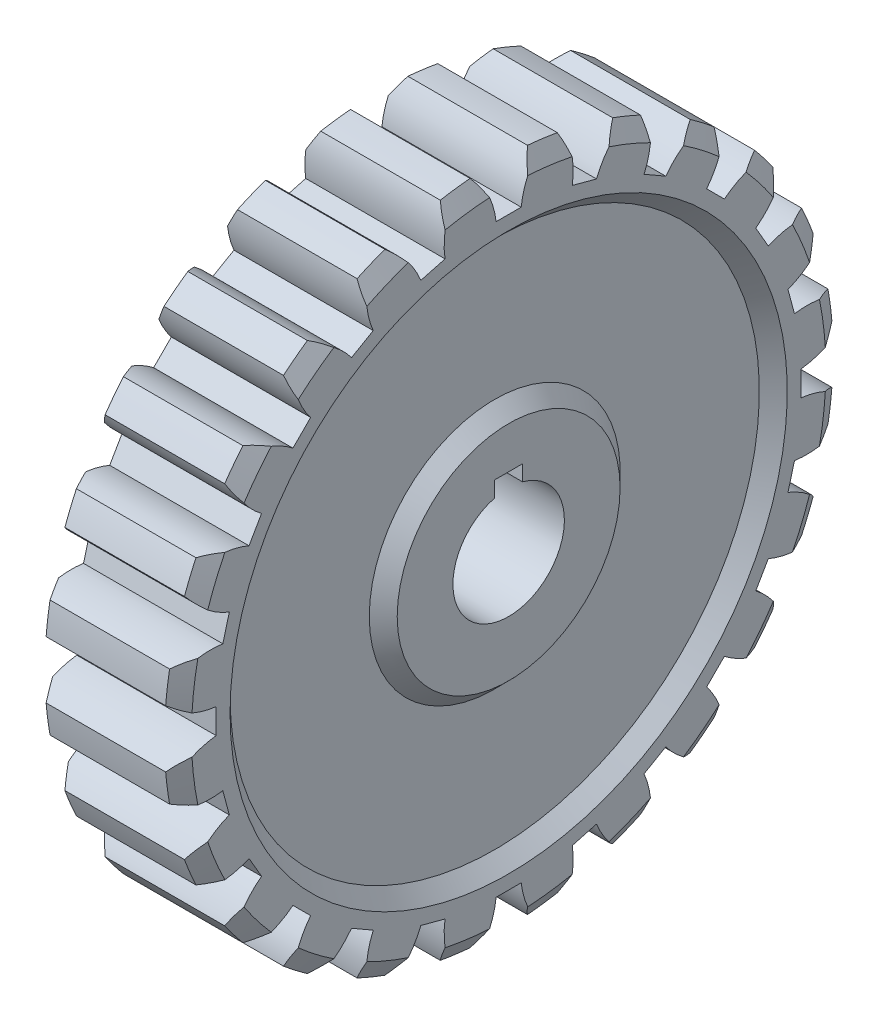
from build123d import *

# Parameters (mm, degrees)
CUT_EXTRUDE1_DEPTH = 113.342968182
CIRPATTERN1_COUNT  = 24
CUT_EXTRUDE2_DEPTH = 112.961539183


with BuildPart() as part:
    # Sketch1 → Revolve1 (revolve)
    with BuildSketch(Plane.XY, mode=Mode.PRIVATE) as revolve1_sk:
        Polygon((-15.875, 12.7), (15.875, 12.7), (15.875, 25.4), (12.7, 28.594639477), (12.7, 60.305360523), (15.875, 63.5), (15.875, 72.299389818), (13.622981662, 76.2), (-13.622981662, 76.2), (-15.875, 72.299389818), (-15.875, 63.5), (-12.7, 60.305360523), (-12.7, 28.594639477), (-15.875, 25.4), align=None)
    revolve(revolve1_sk.sketch.rotate(Axis((0, 0, 0), (1, 0, 0)), 90), axis=Axis((0, 0, 0), (1, 0, 0)))

    # Sketch2 → Cut-Extrude1 (cut, through all)
    with BuildSketch(Plane(origin=(15.875, 0, 0), x_dir=(0, 0, -1), z_dir=(1, 0, 0))):
        with BuildLine():
            Line((-2.8575, 66.675), (2.8575, 66.675))
            ThreePointArc((2.8575, 66.675), (4.084797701, 71.541608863), (6.5405, 75.91878463))
            ThreePointArc((6.5405, 75.91878463), (0, 76.2), (-6.5405, 75.91878463))
            ThreePointArc((-6.5405, 75.91878463), (-4.084797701, 71.541608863), (-2.8575, 66.675))
        make_face()
    cut_extrude1 = extrude(amount=-CUT_EXTRUDE1_DEPTH, mode=Mode.SUBTRACT)

    # CirPattern1: Cut-Extrude1 ×24 about axis
    cirpattern1_axis = Axis((0, 0, 0), (1, 0, 0))
    for i in range(1, CIRPATTERN1_COUNT):
        add(cut_extrude1.rotate(cirpattern1_axis, i * 360 / CIRPATTERN1_COUNT), mode=Mode.SUBTRACT)

    # Sketch3 → Cut-Extrude2 (cut, through all)
    with BuildSketch(Plane(origin=(15.875, 0, 0), x_dir=(0, 0, -1), z_dir=(1, 0, 0))):
        with BuildLine():
            Line((-3.175, 15.875), (3.175, 15.875))
            Line((3.175, 15.875), (3.175, 12.296722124))
            ThreePointArc((3.175, 12.296722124), (0, 12.7), (-3.175, 12.296722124))
            Line((-3.175, 12.296722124), (-3.175, 15.875))
        make_face()
    extrude(amount=-CUT_EXTRUDE2_DEPTH, mode=Mode.SUBTRACT)


solid = part.part
